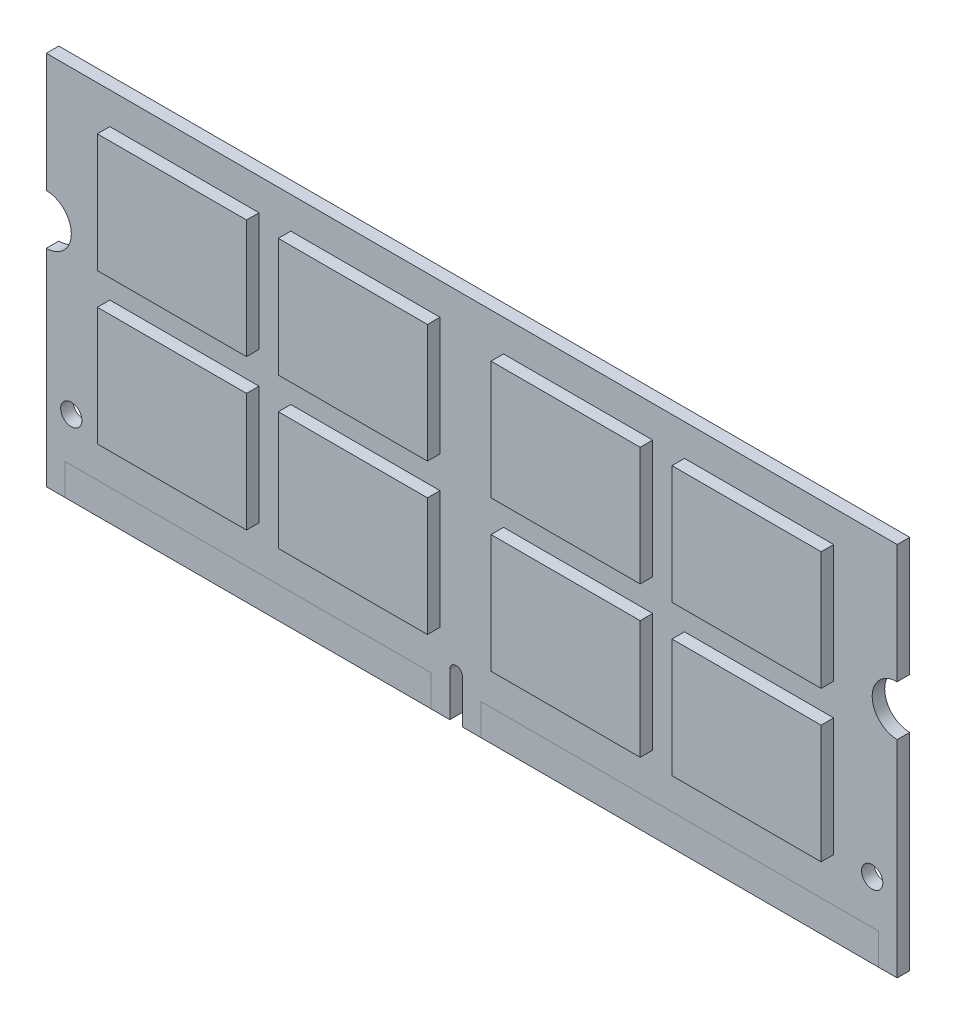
from build123d import *

# Parameters (mm, degrees)
SKETCH1_W                     = 68
SKETCH1_H                     = 30
MAIN_BOARD_DEPTH              = 0.5
MOUNTING_CLIP_GROOVES_DEPTH   = 38.175260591
M1_7_1_7_LOCATING_PIN_HOLES_D = 1.7
LOCATING_SLOT_DEPTH           = 38.175260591
BOSS_EXTRUDE1_DEPTH           = 1
BOSS_EXTRUDE1_DEPTH_BACK      = 2
SKETCH9_W                     = 11.92
SKETCH9_H                     = 9.46
SKETCH10_W                    = 68
SKETCH10_H                    = 9.37
SKETCH10_R                    = 1.2446
BOSS_EXTRUDE2_DEPTH           = 1
SKETCH11_W                    = 68
SKETCH11_H                    = 9.37
CUT_EXTRUDE1_DEPTH            = 42.939204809


with BuildPart() as part:
    # Sketch1 → MAIN BOARD (new, symmetric)
    with BuildSketch(Plane.XY):
        Rectangle(SKETCH1_W, SKETCH1_H)
    extrude(amount=MAIN_BOARD_DEPTH, both=True)

    # Sketch2 → MOUNTING CLIP GROOVES (cut, through all)
    with BuildSketch(Plane.XY.offset(0.5)):
        with BuildLine():
            Line((-34, 5.5), (-34, 1.5))
            ThreePointArc((-34, 1.5), (-32, 3.5), (-34, 5.5))
        make_face()
        with BuildLine():
            Line((34, 5.5), (34, 1.5))
            ThreePointArc((34, 1.5), (32, 3.5), (34, 5.5))
        make_face()
    extrude(amount=-MOUNTING_CLIP_GROOVES_DEPTH, mode=Mode.SUBTRACT)

    # M1.7 _1.7_ LOCATING PIN HOLES (through all)
    with Locations(Plane.XY.offset(0.5)):
        with Locations((-32, -9), (32, -9)):
            Hole(M1_7_1_7_LOCATING_PIN_HOLES_D / 2)

    # Sketch5 → LOCATING SLOT (cut, through all)
    with BuildSketch(Plane.XY.offset(0.5)):
        with BuildLine():
            Line((-1.75, -15), (-1.75, -11.5))
            ThreePointArc((-1.75, -11.5), (-1.25, -11), (-0.75, -11.5))
            Line((-0.75, -11.5), (-0.75, -15))
            Line((-0.75, -15), (-1.75, -15))
        make_face()
    extrude(amount=-LOCATING_SLOT_DEPTH, mode=Mode.SUBTRACT)

    # Sketch9 → Boss-Extrude1 (add, two sides: drawn at the far end of the back side and taken through both)
    with BuildSketch(Plane.XY.offset(0.5).offset(-BOSS_EXTRUDE1_DEPTH_BACK)):
        with Locations((-22.96, 7.73)):
            Rectangle(SKETCH9_W, SKETCH9_H)
        with Locations((-8.5, 7.73)):
            Rectangle(SKETCH9_W, SKETCH9_H)
        with Locations((-22.96, -4.27)):
            Rectangle(SKETCH9_W, SKETCH9_H)
        with Locations((-8.5, -4.27)):
            Rectangle(SKETCH9_W, SKETCH9_H)
        with Locations((8.5, -4.27)):
            Rectangle(SKETCH9_W, SKETCH9_H)
        with Locations((22.96, -4.27)):
            Rectangle(SKETCH9_W, SKETCH9_H)
        with Locations((8.5, 7.73)):
            Rectangle(SKETCH9_W, SKETCH9_H)
        with Locations((22.96, 7.73)):
            Rectangle(SKETCH9_W, SKETCH9_H)
    extrude(amount=BOSS_EXTRUDE1_DEPTH + BOSS_EXTRUDE1_DEPTH_BACK)

    # Sketch10 → Boss-Extrude2 (add)
    with BuildSketch(Plane.XY.offset(0.5)):
        with Locations((0, 19.685)):
            Rectangle(SKETCH10_W, SKETCH10_H)
        with Locations((-22.8473, 19.798)):
            Circle(SKETCH10_R, mode=Mode.SUBTRACT)
        with Locations((22.8473, 19.798)):
            Circle(SKETCH10_R, mode=Mode.SUBTRACT)
    extrude(amount=-BOSS_EXTRUDE2_DEPTH)

    # Sketch11 → Cut-Extrude1 (cut, through all)
    with BuildSketch(Plane(origin=(0, 0, -1.5), x_dir=(-1, 0, 0), z_dir=(0, 0, -1))):
        with Locations((0, 19.685)):
            Rectangle(SKETCH11_W, SKETCH11_H)
    extrude(amount=-CUT_EXTRUDE1_DEPTH, mode=Mode.SUBTRACT)


solid = part.part
